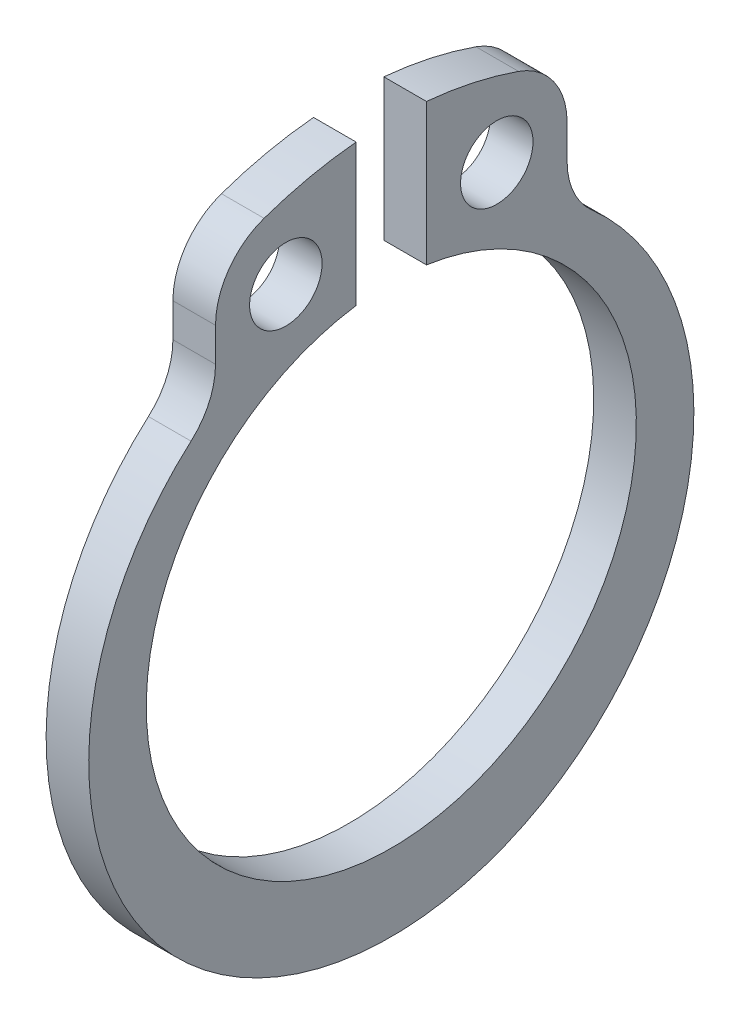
ISO-10303-21;
HEADER;
FILE_DESCRIPTION(('STEP AP214'),'2;1');
FILE_NAME('part.step','',(''),(''),'','','');
FILE_SCHEMA(('AUTOMOTIVE_DESIGN { 1 0 10303 214 1 1 1 1 }'));
ENDSEC;
DATA;
#1=APPLICATION_CONTEXT('core data for automotive mechanical design processes');
#2=APPLICATION_PROTOCOL_DEFINITION('international standard','automotive_design',2000,#1);
#3=PRODUCT_CONTEXT('',#1,'mechanical');
#4=PRODUCT('Part','Part','',(#3));
#5=PRODUCT_RELATED_PRODUCT_CATEGORY('part','',(#4));
#6=PRODUCT_DEFINITION_FORMATION('','',#4);
#7=PRODUCT_DEFINITION_CONTEXT('part definition',#1,'design');
#8=PRODUCT_DEFINITION('design','',#6,#7);
#9=PRODUCT_DEFINITION_SHAPE('','',#8);
#10=(LENGTH_UNIT() NAMED_UNIT(*) SI_UNIT(.MILLI.,.METRE.));
#11=(NAMED_UNIT(*) PLANE_ANGLE_UNIT() SI_UNIT($,.RADIAN.));
#12=(NAMED_UNIT(*) SI_UNIT($,.STERADIAN.) SOLID_ANGLE_UNIT());
#13=UNCERTAINTY_MEASURE_WITH_UNIT(LENGTH_MEASURE(1.E-05),#10,'distance_accuracy_value','');
#14=(GEOMETRIC_REPRESENTATION_CONTEXT(3) GLOBAL_UNCERTAINTY_ASSIGNED_CONTEXT((#13)) GLOBAL_UNIT_ASSIGNED_CONTEXT((#10,
#11,#12)) REPRESENTATION_CONTEXT('',''));
#15=CARTESIAN_POINT('',(0.,0.,0.));
#16=DIRECTION('',(0.,0.,1.));
#17=DIRECTION('',(1.,0.,0.));
#18=AXIS2_PLACEMENT_3D('',#15,#16,#17);
#19=CARTESIAN_POINT('',(1.,6.1461636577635,5.82500000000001));
#20=DIRECTION('',(-1.,0.,0.));
#21=DIRECTION('',(0.,0.,1.));
#22=AXIS2_PLACEMENT_3D('',#19,#20,#21);
#23=PLANE('',#22);
#24=CARTESIAN_POINT('',(1.,6.94753302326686,-2.47500000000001));
#25=DIRECTION('',(1.,0.,0.));
#26=DIRECTION('',(0.,0.,-1.));
#27=AXIS2_PLACEMENT_3D('',#24,#25,#26);
#28=CIRCLE('',#27,0.85);
#29=CARTESIAN_POINT('',(1.,6.94753302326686,-3.32500000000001));
#30=VERTEX_POINT('',#29);
#31=EDGE_CURVE('E153',#30,#30,#28,.T.);
#32=ORIENTED_EDGE('',*,*,#31,.F.);
#33=EDGE_LOOP('',(#32));
#34=FACE_BOUND('',#33,.T.);
#35=CARTESIAN_POINT('',(1.,6.1461636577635,5.82500000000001));
#36=DIRECTION('',(-1.,0.,0.));
#37=DIRECTION('',(0.,0.,1.));
#38=AXIS2_PLACEMENT_3D('',#35,#36,#37);
#39=CIRCLE('',#38,1.7);
#40=CARTESIAN_POINT('',(1.,6.14616365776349,4.12500000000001));
#41=VERTEX_POINT('',#40);
#42=CARTESIAN_POINT('',(1.,4.87190476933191,4.69971590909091));
#43=VERTEX_POINT('',#42);
#44=EDGE_CURVE('E172',#41,#43,#39,.T.);
#45=ORIENTED_EDGE('',*,*,#44,.T.);
#46=CARTESIAN_POINT('',(1.,-0.45,0.));
#47=DIRECTION('',(1.,0.,0.));
#48=DIRECTION('',(0.,0.,-1.));
#49=AXIS2_PLACEMENT_3D('',#46,#47,#48);
#50=CIRCLE('',#49,7.1);
#51=CARTESIAN_POINT('',(1.,4.87190476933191,-4.69971590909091));
#52=VERTEX_POINT('',#51);
#53=EDGE_CURVE('E100',#43,#52,#50,.T.);
#54=ORIENTED_EDGE('',*,*,#53,.T.);
#55=CARTESIAN_POINT('',(1.,6.1461636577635,-5.82500000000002));
#56=DIRECTION('',(-1.,0.,0.));
#57=DIRECTION('',(0.,0.,1.));
#58=AXIS2_PLACEMENT_3D('',#55,#56,#57);
#59=CIRCLE('',#58,1.70000000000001);
#60=CARTESIAN_POINT('',(1.,6.1461636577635,-4.12500000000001));
#61=VERTEX_POINT('',#60);
#62=EDGE_CURVE('E199',#52,#61,#59,.T.);
#63=ORIENTED_EDGE('',*,*,#62,.T.);
#64=DIRECTION('',(0.,1.,0.));
#65=VECTOR('',#64,1.);
#66=CARTESIAN_POINT('',(1.,6.1461636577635,-4.12500000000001));
#67=LINE('',#66,#65);
#68=CARTESIAN_POINT('',(1.,6.93843462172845,-4.12500000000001));
#69=VERTEX_POINT('',#68);
#70=EDGE_CURVE('E218',#61,#69,#67,.T.);
#71=ORIENTED_EDGE('',*,*,#70,.T.);
#72=CARTESIAN_POINT('',(1.,6.93843462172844,-2.425));
#73=DIRECTION('',(1.,0.,0.));
#74=DIRECTION('',(0.,0.,-1.));
#75=AXIS2_PLACEMENT_3D('',#72,#73,#74);
#76=CIRCLE('',#75,1.70000000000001);
#77=CARTESIAN_POINT('',(1.,8.54324262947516,-2.9858843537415));
#78=VERTEX_POINT('',#77);
#79=EDGE_CURVE('E215',#69,#78,#76,.T.);
#80=ORIENTED_EDGE('',*,*,#79,.T.);
#81=CARTESIAN_POINT('',(1.,-1.23165366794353E-13,0.));
#82=DIRECTION('',(1.,0.,0.));
#83=DIRECTION('',(0.,0.,-1.));
#84=AXIS2_PLACEMENT_3D('',#81,#82,#83);
#85=CIRCLE('',#84,9.05000000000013);
#86=CARTESIAN_POINT('',(1.,9.01231795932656,-0.824999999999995));
#87=VERTEX_POINT('',#86);
#88=EDGE_CURVE('E217',#78,#87,#85,.T.);
#89=ORIENTED_EDGE('',*,*,#88,.T.);
#90=DIRECTION('',(0.,-1.,0.));
#91=VECTOR('',#90,1.);
#92=CARTESIAN_POINT('',(1.,9.01231795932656,-0.824999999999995));
#93=LINE('',#92,#91);
#94=CARTESIAN_POINT('',(1.,5.69050744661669,-0.824999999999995));
#95=VERTEX_POINT('',#94);
#96=EDGE_CURVE('E220',#87,#95,#93,.T.);
#97=ORIENTED_EDGE('',*,*,#96,.T.);
#98=CARTESIAN_POINT('',(1.,-1.23165366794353E-13,0.));
#99=DIRECTION('',(-1.,0.,0.));
#100=DIRECTION('',(0.,0.,1.));
#101=AXIS2_PLACEMENT_3D('',#98,#99,#100);
#102=CIRCLE('',#101,5.75000000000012);
#103=CARTESIAN_POINT('',(1.,5.69050744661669,0.824999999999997));
#104=VERTEX_POINT('',#103);
#105=EDGE_CURVE('E226',#95,#104,#102,.T.);
#106=ORIENTED_EDGE('',*,*,#105,.T.);
#107=DIRECTION('',(0.,1.,0.));
#108=VECTOR('',#107,1.);
#109=CARTESIAN_POINT('',(1.,5.69050744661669,0.824999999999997));
#110=LINE('',#109,#108);
#111=CARTESIAN_POINT('',(1.,9.01231795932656,0.824999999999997));
#112=VERTEX_POINT('',#111);
#113=EDGE_CURVE('E131',#104,#112,#110,.T.);
#114=ORIENTED_EDGE('',*,*,#113,.T.);
#115=CARTESIAN_POINT('',(1.,-1.23165366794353E-13,0.));
#116=DIRECTION('',(1.,0.,0.));
#117=DIRECTION('',(0.,0.,-1.));
#118=AXIS2_PLACEMENT_3D('',#115,#116,#117);
#119=CIRCLE('',#118,9.05000000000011);
#120=CARTESIAN_POINT('',(1.,8.54324262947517,2.98588435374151));
#121=VERTEX_POINT('',#120);
#122=EDGE_CURVE('E125',#112,#121,#119,.T.);
#123=ORIENTED_EDGE('',*,*,#122,.T.);
#124=CARTESIAN_POINT('',(1.,6.93843462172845,2.42500000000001));
#125=DIRECTION('',(1.,0.,0.));
#126=DIRECTION('',(0.,0.,-1.));
#127=AXIS2_PLACEMENT_3D('',#124,#125,#126);
#128=CIRCLE('',#127,1.7);
#129=CARTESIAN_POINT('',(1.,6.93843462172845,4.12500000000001));
#130=VERTEX_POINT('',#129);
#131=EDGE_CURVE('E129',#121,#130,#128,.T.);
#132=ORIENTED_EDGE('',*,*,#131,.T.);
#133=DIRECTION('',(0.,-1.,0.));
#134=VECTOR('',#133,1.);
#135=CARTESIAN_POINT('',(1.,6.93843462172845,4.12500000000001));
#136=LINE('',#135,#134);
#137=EDGE_CURVE('E45',#130,#41,#136,.T.);
#138=ORIENTED_EDGE('',*,*,#137,.T.);
#139=EDGE_LOOP('',(#45,#54,#63,#71,#80,#89,#97,#106,#114,#123,#132,#138));
#140=FACE_BOUND('',#139,.T.);
#141=CARTESIAN_POINT('',(1.,6.94753302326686,2.47500000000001));
#142=DIRECTION('',(1.,0.,0.));
#143=DIRECTION('',(0.,0.,-1.));
#144=AXIS2_PLACEMENT_3D('',#141,#142,#143);
#145=CIRCLE('',#144,0.85);
#146=CARTESIAN_POINT('',(1.,6.94753302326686,1.62500000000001));
#147=VERTEX_POINT('',#146);
#148=EDGE_CURVE('E269',#147,#147,#145,.T.);
#149=ORIENTED_EDGE('',*,*,#148,.F.);
#150=EDGE_LOOP('',(#149));
#151=FACE_BOUND('',#150,.T.);
#152=ADVANCED_FACE('F28',(#34,#140,#151),#23,.F.);
#153=CARTESIAN_POINT('',(0.,6.1461636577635,5.82500000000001));
#154=DIRECTION('',(-1.,0.,0.));
#155=DIRECTION('',(0.,0.,1.));
#156=AXIS2_PLACEMENT_3D('',#153,#154,#155);
#157=PLANE('',#156);
#158=CARTESIAN_POINT('',(0.,6.94753302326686,-2.47500000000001));
#159=DIRECTION('',(1.,0.,0.));
#160=DIRECTION('',(0.,0.,-1.));
#161=AXIS2_PLACEMENT_3D('',#158,#159,#160);
#162=CIRCLE('',#161,0.85);
#163=CARTESIAN_POINT('',(0.,6.94753302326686,-3.32500000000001));
#164=VERTEX_POINT('',#163);
#165=EDGE_CURVE('E274',#164,#164,#162,.T.);
#166=ORIENTED_EDGE('',*,*,#165,.T.);
#167=EDGE_LOOP('',(#166));
#168=FACE_BOUND('',#167,.T.);
#169=CARTESIAN_POINT('',(0.,6.1461636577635,5.82500000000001));
#170=DIRECTION('',(-1.,0.,0.));
#171=DIRECTION('',(0.,0.,1.));
#172=AXIS2_PLACEMENT_3D('',#169,#170,#171);
#173=CIRCLE('',#172,1.7);
#174=CARTESIAN_POINT('',(0.,6.14616365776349,4.12500000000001));
#175=VERTEX_POINT('',#174);
#176=CARTESIAN_POINT('',(0.,4.87190476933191,4.69971590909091));
#177=VERTEX_POINT('',#176);
#178=EDGE_CURVE('E149',#175,#177,#173,.T.);
#179=ORIENTED_EDGE('',*,*,#178,.F.);
#180=DIRECTION('',(0.,-1.,0.));
#181=VECTOR('',#180,1.);
#182=CARTESIAN_POINT('',(0.,6.93843462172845,4.12500000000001));
#183=LINE('',#182,#181);
#184=CARTESIAN_POINT('',(0.,6.93843462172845,4.12500000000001));
#185=VERTEX_POINT('',#184);
#186=EDGE_CURVE('E92',#185,#175,#183,.T.);
#187=ORIENTED_EDGE('',*,*,#186,.F.);
#188=CARTESIAN_POINT('',(0.,6.93843462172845,2.42500000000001));
#189=DIRECTION('',(1.,0.,0.));
#190=DIRECTION('',(0.,0.,-1.));
#191=AXIS2_PLACEMENT_3D('',#188,#189,#190);
#192=CIRCLE('',#191,1.7);
#193=CARTESIAN_POINT('',(0.,8.54324262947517,2.98588435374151));
#194=VERTEX_POINT('',#193);
#195=EDGE_CURVE('E86',#194,#185,#192,.T.);
#196=ORIENTED_EDGE('',*,*,#195,.F.);
#197=CARTESIAN_POINT('',(0.,-1.23165366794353E-13,0.));
#198=DIRECTION('',(1.,0.,0.));
#199=DIRECTION('',(0.,0.,-1.));
#200=AXIS2_PLACEMENT_3D('',#197,#198,#199);
#201=CIRCLE('',#200,9.05000000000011);
#202=CARTESIAN_POINT('',(0.,9.01231795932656,0.824999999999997));
#203=VERTEX_POINT('',#202);
#204=EDGE_CURVE('E139',#203,#194,#201,.T.);
#205=ORIENTED_EDGE('',*,*,#204,.F.);
#206=DIRECTION('',(0.,1.,0.));
#207=VECTOR('',#206,1.);
#208=CARTESIAN_POINT('',(0.,5.69050744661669,0.824999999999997));
#209=LINE('',#208,#207);
#210=CARTESIAN_POINT('',(0.,5.69050744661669,0.824999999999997));
#211=VERTEX_POINT('',#210);
#212=EDGE_CURVE('E167',#211,#203,#209,.T.);
#213=ORIENTED_EDGE('',*,*,#212,.F.);
#214=CARTESIAN_POINT('',(0.,-1.23165366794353E-13,0.));
#215=DIRECTION('',(-1.,0.,0.));
#216=DIRECTION('',(0.,0.,1.));
#217=AXIS2_PLACEMENT_3D('',#214,#215,#216);
#218=CIRCLE('',#217,5.75000000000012);
#219=CARTESIAN_POINT('',(0.,5.69050744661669,-0.824999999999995));
#220=VERTEX_POINT('',#219);
#221=EDGE_CURVE('E165',#220,#211,#218,.T.);
#222=ORIENTED_EDGE('',*,*,#221,.F.);
#223=DIRECTION('',(0.,-1.,0.));
#224=VECTOR('',#223,1.);
#225=CARTESIAN_POINT('',(0.,9.01231795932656,-0.824999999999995));
#226=LINE('',#225,#224);
#227=CARTESIAN_POINT('',(0.,9.01231795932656,-0.824999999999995));
#228=VERTEX_POINT('',#227);
#229=EDGE_CURVE('E163',#228,#220,#226,.T.);
#230=ORIENTED_EDGE('',*,*,#229,.F.);
#231=CARTESIAN_POINT('',(0.,-1.23165366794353E-13,0.));
#232=DIRECTION('',(1.,0.,0.));
#233=DIRECTION('',(0.,0.,-1.));
#234=AXIS2_PLACEMENT_3D('',#231,#232,#233);
#235=CIRCLE('',#234,9.05000000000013);
#236=CARTESIAN_POINT('',(0.,8.54324262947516,-2.9858843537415));
#237=VERTEX_POINT('',#236);
#238=EDGE_CURVE('E161',#237,#228,#235,.T.);
#239=ORIENTED_EDGE('',*,*,#238,.F.);
#240=CARTESIAN_POINT('',(0.,6.93843462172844,-2.425));
#241=DIRECTION('',(1.,0.,0.));
#242=DIRECTION('',(0.,0.,-1.));
#243=AXIS2_PLACEMENT_3D('',#240,#241,#242);
#244=CIRCLE('',#243,1.70000000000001);
#245=CARTESIAN_POINT('',(0.,6.93843462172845,-4.12500000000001));
#246=VERTEX_POINT('',#245);
#247=EDGE_CURVE('E159',#246,#237,#244,.T.);
#248=ORIENTED_EDGE('',*,*,#247,.F.);
#249=DIRECTION('',(0.,1.,0.));
#250=VECTOR('',#249,1.);
#251=CARTESIAN_POINT('',(0.,6.1461636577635,-4.12500000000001));
#252=LINE('',#251,#250);
#253=CARTESIAN_POINT('',(0.,6.1461636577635,-4.12500000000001));
#254=VERTEX_POINT('',#253);
#255=EDGE_CURVE('E157',#254,#246,#252,.T.);
#256=ORIENTED_EDGE('',*,*,#255,.F.);
#257=CARTESIAN_POINT('',(0.,6.1461636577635,-5.82500000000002));
#258=DIRECTION('',(-1.,0.,0.));
#259=DIRECTION('',(0.,0.,1.));
#260=AXIS2_PLACEMENT_3D('',#257,#258,#259);
#261=CIRCLE('',#260,1.70000000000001);
#262=CARTESIAN_POINT('',(0.,4.87190476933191,-4.69971590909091));
#263=VERTEX_POINT('',#262);
#264=EDGE_CURVE('E155',#263,#254,#261,.T.);
#265=ORIENTED_EDGE('',*,*,#264,.F.);
#266=CARTESIAN_POINT('',(0.,-0.45,0.));
#267=DIRECTION('',(1.,0.,0.));
#268=DIRECTION('',(0.,0.,-1.));
#269=AXIS2_PLACEMENT_3D('',#266,#267,#268);
#270=CIRCLE('',#269,7.1);
#271=EDGE_CURVE('E152',#177,#263,#270,.T.);
#272=ORIENTED_EDGE('',*,*,#271,.F.);
#273=EDGE_LOOP('',(#179,#187,#196,#205,#213,#222,#230,#239,#248,#256,#265,#272));
#274=FACE_BOUND('',#273,.T.);
#275=CARTESIAN_POINT('',(0.,6.94753302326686,2.47500000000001));
#276=DIRECTION('',(1.,0.,0.));
#277=DIRECTION('',(0.,0.,-1.));
#278=AXIS2_PLACEMENT_3D('',#275,#276,#277);
#279=CIRCLE('',#278,0.85);
#280=CARTESIAN_POINT('',(0.,6.94753302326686,1.62500000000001));
#281=VERTEX_POINT('',#280);
#282=EDGE_CURVE('E272',#281,#281,#279,.T.);
#283=ORIENTED_EDGE('',*,*,#282,.T.);
#284=EDGE_LOOP('',(#283));
#285=FACE_BOUND('',#284,.T.);
#286=ADVANCED_FACE('F203',(#168,#274,#285),#157,.T.);
#287=CARTESIAN_POINT('',(1.,6.1461636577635,5.82500000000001));
#288=DIRECTION('',(-1.,0.,0.));
#289=DIRECTION('',(0.,0.,1.));
#290=AXIS2_PLACEMENT_3D('',#287,#288,#289);
#291=CYLINDRICAL_SURFACE('',#290,1.7);
#292=ORIENTED_EDGE('',*,*,#178,.T.);
#293=DIRECTION('',(-1.,0.,0.));
#294=VECTOR('',#293,1.);
#295=CARTESIAN_POINT('',(1.,4.87190476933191,4.69971590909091));
#296=LINE('',#295,#294);
#297=EDGE_CURVE('E11',#43,#177,#296,.T.);
#298=ORIENTED_EDGE('',*,*,#297,.F.);
#299=ORIENTED_EDGE('',*,*,#44,.F.);
#300=DIRECTION('',(-1.,0.,0.));
#301=VECTOR('',#300,1.);
#302=CARTESIAN_POINT('',(1.,6.14616365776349,4.12500000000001));
#303=LINE('',#302,#301);
#304=EDGE_CURVE('E145',#41,#175,#303,.T.);
#305=ORIENTED_EDGE('',*,*,#304,.T.);
#306=EDGE_LOOP('',(#292,#298,#299,#305));
#307=FACE_BOUND('',#306,.T.);
#308=ADVANCED_FACE('F30',(#307),#291,.F.);
#309=CARTESIAN_POINT('',(1.,-0.45,0.));
#310=DIRECTION('',(-1.,0.,0.));
#311=DIRECTION('',(0.,0.,1.));
#312=AXIS2_PLACEMENT_3D('',#309,#310,#311);
#313=CYLINDRICAL_SURFACE('',#312,7.1);
#314=ORIENTED_EDGE('',*,*,#271,.T.);
#315=DIRECTION('',(-1.,0.,0.));
#316=VECTOR('',#315,1.);
#317=CARTESIAN_POINT('',(1.,4.87190476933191,-4.69971590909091));
#318=LINE('',#317,#316);
#319=EDGE_CURVE('E37',#52,#263,#318,.T.);
#320=ORIENTED_EDGE('',*,*,#319,.F.);
#321=ORIENTED_EDGE('',*,*,#53,.F.);
#322=ORIENTED_EDGE('',*,*,#297,.T.);
#323=EDGE_LOOP('',(#314,#320,#321,#322));
#324=FACE_BOUND('',#323,.T.);
#325=ADVANCED_FACE('F367',(#324),#313,.T.);
#326=CARTESIAN_POINT('',(1.,6.1461636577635,-5.82500000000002));
#327=DIRECTION('',(-1.,0.,0.));
#328=DIRECTION('',(0.,0.,1.));
#329=AXIS2_PLACEMENT_3D('',#326,#327,#328);
#330=CYLINDRICAL_SURFACE('',#329,1.70000000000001);
#331=ORIENTED_EDGE('',*,*,#264,.T.);
#332=DIRECTION('',(-1.,0.,0.));
#333=VECTOR('',#332,1.);
#334=CARTESIAN_POINT('',(1.,6.1461636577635,-4.12500000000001));
#335=LINE('',#334,#333);
#336=EDGE_CURVE('E191',#61,#254,#335,.T.);
#337=ORIENTED_EDGE('',*,*,#336,.F.);
#338=ORIENTED_EDGE('',*,*,#62,.F.);
#339=ORIENTED_EDGE('',*,*,#319,.T.);
#340=EDGE_LOOP('',(#331,#337,#338,#339));
#341=FACE_BOUND('',#340,.T.);
#342=ADVANCED_FACE('F197',(#341),#330,.F.);
#343=CARTESIAN_POINT('',(1.,6.1461636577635,-4.12500000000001));
#344=DIRECTION('',(0.,0.,1.));
#345=DIRECTION('',(1.,0.,0.));
#346=AXIS2_PLACEMENT_3D('',#343,#344,#345);
#347=PLANE('',#346);
#348=ORIENTED_EDGE('',*,*,#255,.T.);
#349=DIRECTION('',(-1.,0.,0.));
#350=VECTOR('',#349,1.);
#351=CARTESIAN_POINT('',(1.,6.93843462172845,-4.12500000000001));
#352=LINE('',#351,#350);
#353=EDGE_CURVE('E188',#69,#246,#352,.T.);
#354=ORIENTED_EDGE('',*,*,#353,.F.);
#355=ORIENTED_EDGE('',*,*,#70,.F.);
#356=ORIENTED_EDGE('',*,*,#336,.T.);
#357=EDGE_LOOP('',(#348,#354,#355,#356));
#358=FACE_BOUND('',#357,.T.);
#359=ADVANCED_FACE('F209',(#358),#347,.F.);
#360=CARTESIAN_POINT('',(1.,6.93843462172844,-2.425));
#361=DIRECTION('',(-1.,0.,0.));
#362=DIRECTION('',(0.,0.,1.));
#363=AXIS2_PLACEMENT_3D('',#360,#361,#362);
#364=CYLINDRICAL_SURFACE('',#363,1.70000000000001);
#365=ORIENTED_EDGE('',*,*,#247,.T.);
#366=DIRECTION('',(-1.,0.,0.));
#367=VECTOR('',#366,1.);
#368=CARTESIAN_POINT('',(1.,8.54324262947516,-2.9858843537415));
#369=LINE('',#368,#367);
#370=EDGE_CURVE('E185',#78,#237,#369,.T.);
#371=ORIENTED_EDGE('',*,*,#370,.F.);
#372=ORIENTED_EDGE('',*,*,#79,.F.);
#373=ORIENTED_EDGE('',*,*,#353,.T.);
#374=EDGE_LOOP('',(#365,#371,#372,#373));
#375=FACE_BOUND('',#374,.T.);
#376=ADVANCED_FACE('F213',(#375),#364,.T.);
#377=CARTESIAN_POINT('',(1.,-1.23165366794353E-13,0.));
#378=DIRECTION('',(-1.,0.,0.));
#379=DIRECTION('',(0.,0.,1.));
#380=AXIS2_PLACEMENT_3D('',#377,#378,#379);
#381=CYLINDRICAL_SURFACE('',#380,9.05000000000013);
#382=ORIENTED_EDGE('',*,*,#238,.T.);
#383=DIRECTION('',(-1.,0.,0.));
#384=VECTOR('',#383,1.);
#385=CARTESIAN_POINT('',(1.,9.01231795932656,-0.824999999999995));
#386=LINE('',#385,#384);
#387=EDGE_CURVE('E182',#87,#228,#386,.T.);
#388=ORIENTED_EDGE('',*,*,#387,.F.);
#389=ORIENTED_EDGE('',*,*,#88,.F.);
#390=ORIENTED_EDGE('',*,*,#370,.T.);
#391=EDGE_LOOP('',(#382,#388,#389,#390));
#392=FACE_BOUND('',#391,.T.);
#393=ADVANCED_FACE('F332',(#392),#381,.T.);
#394=CARTESIAN_POINT('',(1.,9.01231795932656,-0.824999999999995));
#395=DIRECTION('',(0.,0.,-1.));
#396=DIRECTION('',(0.,1.,0.));
#397=AXIS2_PLACEMENT_3D('',#394,#395,#396);
#398=PLANE('',#397);
#399=ORIENTED_EDGE('',*,*,#229,.T.);
#400=DIRECTION('',(-1.,0.,0.));
#401=VECTOR('',#400,1.);
#402=CARTESIAN_POINT('',(1.,5.69050744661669,-0.824999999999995));
#403=LINE('',#402,#401);
#404=EDGE_CURVE('E179',#95,#220,#403,.T.);
#405=ORIENTED_EDGE('',*,*,#404,.F.);
#406=ORIENTED_EDGE('',*,*,#96,.F.);
#407=ORIENTED_EDGE('',*,*,#387,.T.);
#408=EDGE_LOOP('',(#399,#405,#406,#407));
#409=FACE_BOUND('',#408,.T.);
#410=ADVANCED_FACE('F323',(#409),#398,.F.);
#411=CARTESIAN_POINT('',(1.,-1.23165366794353E-13,0.));
#412=DIRECTION('',(-1.,0.,0.));
#413=DIRECTION('',(0.,0.,1.));
#414=AXIS2_PLACEMENT_3D('',#411,#412,#413);
#415=CYLINDRICAL_SURFACE('',#414,5.75000000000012);
#416=ORIENTED_EDGE('',*,*,#221,.T.);
#417=DIRECTION('',(-1.,0.,0.));
#418=VECTOR('',#417,1.);
#419=CARTESIAN_POINT('',(1.,5.69050744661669,0.824999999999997));
#420=LINE('',#419,#418);
#421=EDGE_CURVE('E176',#104,#211,#420,.T.);
#422=ORIENTED_EDGE('',*,*,#421,.F.);
#423=ORIENTED_EDGE('',*,*,#105,.F.);
#424=ORIENTED_EDGE('',*,*,#404,.T.);
#425=EDGE_LOOP('',(#416,#422,#423,#424));
#426=FACE_BOUND('',#425,.T.);
#427=ADVANCED_FACE('F232',(#426),#415,.F.);
#428=CARTESIAN_POINT('',(1.,5.69050744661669,0.824999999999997));
#429=DIRECTION('',(0.,0.,1.));
#430=DIRECTION('',(0.,-1.,0.));
#431=AXIS2_PLACEMENT_3D('',#428,#429,#430);
#432=PLANE('',#431);
#433=ORIENTED_EDGE('',*,*,#212,.T.);
#434=DIRECTION('',(-1.,0.,0.));
#435=VECTOR('',#434,1.);
#436=CARTESIAN_POINT('',(1.,9.01231795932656,0.824999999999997));
#437=LINE('',#436,#435);
#438=EDGE_CURVE('E140',#112,#203,#437,.T.);
#439=ORIENTED_EDGE('',*,*,#438,.F.);
#440=ORIENTED_EDGE('',*,*,#113,.F.);
#441=ORIENTED_EDGE('',*,*,#421,.T.);
#442=EDGE_LOOP('',(#433,#439,#440,#441));
#443=FACE_BOUND('',#442,.T.);
#444=ADVANCED_FACE('F236',(#443),#432,.F.);
#445=CARTESIAN_POINT('',(1.,-1.23165366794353E-13,0.));
#446=DIRECTION('',(-1.,0.,0.));
#447=DIRECTION('',(0.,0.,1.));
#448=AXIS2_PLACEMENT_3D('',#445,#446,#447);
#449=CYLINDRICAL_SURFACE('',#448,9.05000000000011);
#450=ORIENTED_EDGE('',*,*,#204,.T.);
#451=DIRECTION('',(-1.,0.,0.));
#452=VECTOR('',#451,1.);
#453=CARTESIAN_POINT('',(1.,8.54324262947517,2.98588435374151));
#454=LINE('',#453,#452);
#455=EDGE_CURVE('E136',#121,#194,#454,.T.);
#456=ORIENTED_EDGE('',*,*,#455,.F.);
#457=ORIENTED_EDGE('',*,*,#122,.F.);
#458=ORIENTED_EDGE('',*,*,#438,.T.);
#459=EDGE_LOOP('',(#450,#456,#457,#458));
#460=FACE_BOUND('',#459,.T.);
#461=ADVANCED_FACE('F137',(#460),#449,.T.);
#462=CARTESIAN_POINT('',(1.,6.93843462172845,2.42500000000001));
#463=DIRECTION('',(-1.,0.,0.));
#464=DIRECTION('',(0.,0.,1.));
#465=AXIS2_PLACEMENT_3D('',#462,#463,#464);
#466=CYLINDRICAL_SURFACE('',#465,1.7);
#467=ORIENTED_EDGE('',*,*,#195,.T.);
#468=DIRECTION('',(-1.,0.,0.));
#469=VECTOR('',#468,1.);
#470=CARTESIAN_POINT('',(1.,6.93843462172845,4.12500000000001));
#471=LINE('',#470,#469);
#472=EDGE_CURVE('E141',#130,#185,#471,.T.);
#473=ORIENTED_EDGE('',*,*,#472,.F.);
#474=ORIENTED_EDGE('',*,*,#131,.F.);
#475=ORIENTED_EDGE('',*,*,#455,.T.);
#476=EDGE_LOOP('',(#467,#473,#474,#475));
#477=FACE_BOUND('',#476,.T.);
#478=ADVANCED_FACE('F143',(#477),#466,.T.);
#479=CARTESIAN_POINT('',(1.,6.93843462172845,4.12500000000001));
#480=DIRECTION('',(0.,0.,-1.));
#481=DIRECTION('',(-1.,0.,0.));
#482=AXIS2_PLACEMENT_3D('',#479,#480,#481);
#483=PLANE('',#482);
#484=ORIENTED_EDGE('',*,*,#186,.T.);
#485=ORIENTED_EDGE('',*,*,#304,.F.);
#486=ORIENTED_EDGE('',*,*,#137,.F.);
#487=ORIENTED_EDGE('',*,*,#472,.T.);
#488=EDGE_LOOP('',(#484,#485,#486,#487));
#489=FACE_BOUND('',#488,.T.);
#490=ADVANCED_FACE('F240',(#489),#483,.F.);
#491=CARTESIAN_POINT('',(1.,6.94753302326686,-2.47500000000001));
#492=DIRECTION('',(-1.,0.,0.));
#493=DIRECTION('',(0.,0.,1.));
#494=AXIS2_PLACEMENT_3D('',#491,#492,#493);
#495=CYLINDRICAL_SURFACE('',#494,0.85);
#496=ORIENTED_EDGE('',*,*,#31,.T.);
#497=EDGE_LOOP('',(#496));
#498=FACE_BOUND('',#497,.T.);
#499=ORIENTED_EDGE('',*,*,#165,.F.);
#500=EDGE_LOOP('',(#499));
#501=FACE_BOUND('',#500,.T.);
#502=ADVANCED_FACE('F242',(#498,#501),#495,.F.);
#503=CARTESIAN_POINT('',(1.,6.94753302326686,2.47500000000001));
#504=DIRECTION('',(-1.,0.,0.));
#505=DIRECTION('',(0.,0.,1.));
#506=AXIS2_PLACEMENT_3D('',#503,#504,#505);
#507=CYLINDRICAL_SURFACE('',#506,0.85);
#508=ORIENTED_EDGE('',*,*,#148,.T.);
#509=EDGE_LOOP('',(#508));
#510=FACE_BOUND('',#509,.T.);
#511=ORIENTED_EDGE('',*,*,#282,.F.);
#512=EDGE_LOOP('',(#511));
#513=FACE_BOUND('',#512,.T.);
#514=ADVANCED_FACE('F248',(#510,#513),#507,.F.);
#515=CLOSED_SHELL('',(#152,#286,#308,#325,#342,#359,#376,#393,#410,#427,#444,#461,#478,#490,
#502,#514));
#516=MANIFOLD_SOLID_BREP('B2',#515);
#517=ADVANCED_BREP_SHAPE_REPRESENTATION('',(#18,#516),#14);
#518=SHAPE_DEFINITION_REPRESENTATION(#9,#517);
ENDSEC;
END-ISO-10303-21;
